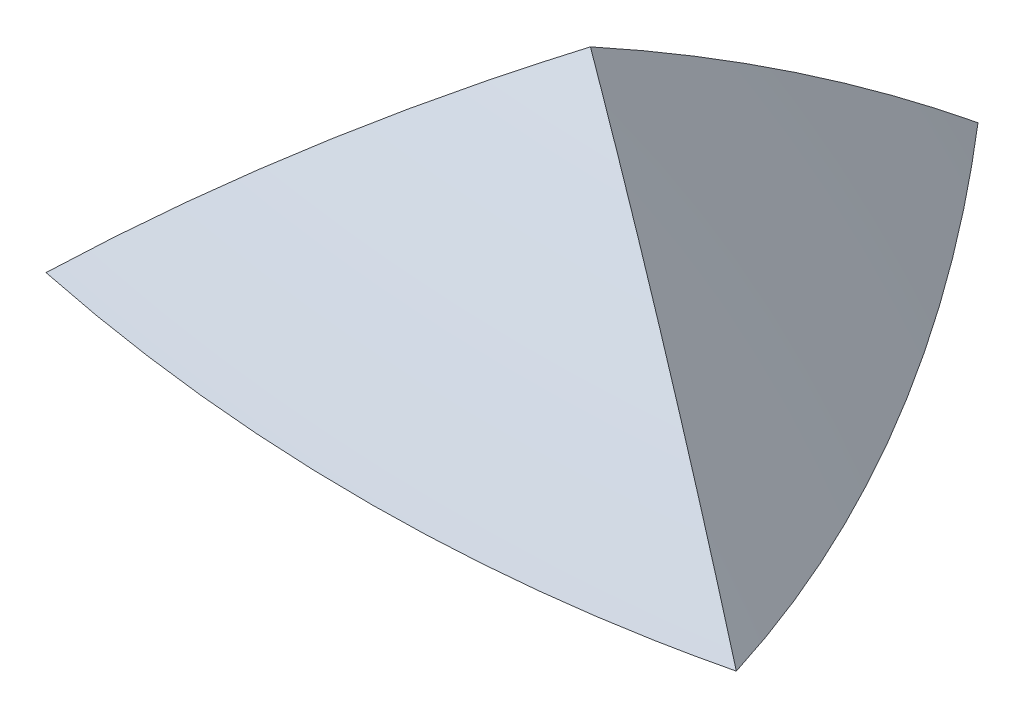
ISO-10303-21;
HEADER;
FILE_DESCRIPTION(('STEP AP214'),'2;1');
FILE_NAME('part.step','',(''),(''),'','','');
FILE_SCHEMA(('AUTOMOTIVE_DESIGN { 1 0 10303 214 1 1 1 1 }'));
ENDSEC;
DATA;
#1=APPLICATION_CONTEXT('core data for automotive mechanical design processes');
#2=APPLICATION_PROTOCOL_DEFINITION('international standard','automotive_design',2000,#1);
#3=PRODUCT_CONTEXT('',#1,'mechanical');
#4=PRODUCT('Part','Part','',(#3));
#5=PRODUCT_RELATED_PRODUCT_CATEGORY('part','',(#4));
#6=PRODUCT_DEFINITION_FORMATION('','',#4);
#7=PRODUCT_DEFINITION_CONTEXT('part definition',#1,'design');
#8=PRODUCT_DEFINITION('design','',#6,#7);
#9=PRODUCT_DEFINITION_SHAPE('','',#8);
#10=(LENGTH_UNIT() NAMED_UNIT(*) SI_UNIT(.MILLI.,.METRE.));
#11=(NAMED_UNIT(*) PLANE_ANGLE_UNIT() SI_UNIT($,.RADIAN.));
#12=(NAMED_UNIT(*) SI_UNIT($,.STERADIAN.) SOLID_ANGLE_UNIT());
#13=UNCERTAINTY_MEASURE_WITH_UNIT(LENGTH_MEASURE(1.E-05),#10,'distance_accuracy_value','');
#14=(GEOMETRIC_REPRESENTATION_CONTEXT(3) GLOBAL_UNCERTAINTY_ASSIGNED_CONTEXT((#13)) GLOBAL_UNIT_ASSIGNED_CONTEXT((#10,
#11,#12)) REPRESENTATION_CONTEXT('',''));
#15=CARTESIAN_POINT('',(0.,0.,0.));
#16=DIRECTION('',(0.,0.,1.));
#17=DIRECTION('',(1.,0.,0.));
#18=AXIS2_PLACEMENT_3D('',#15,#16,#17);
#19=CARTESIAN_POINT('',(0.,513.360685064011,2.99417763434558));
#20=DIRECTION('',(-1.,0.,0.));
#21=DIRECTION('',(0.,-0.981627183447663,-0.190808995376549));
#22=AXIS2_PLACEMENT_3D('',#19,#20,#21);
#23=DEGENERATE_TOROIDAL_SURFACE('',#22,255.10822368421,766.90822368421,.F.);
#24=CARTESIAN_POINT('',(13.5371691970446,9.30922297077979,-85.0346370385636));
#25=CARTESIAN_POINT('',(10.5148602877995,8.69471518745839,-81.8262953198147));
#26=CARTESIAN_POINT('',(7.54687147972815,8.12082598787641,-78.5589356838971));
#27=CARTESIAN_POINT('',(1.72429613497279,7.05700209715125,-71.9112039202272));
#28=CARTESIAN_POINT('',(-1.13028542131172,6.56707108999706,-68.5308268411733));
#29=CARTESIAN_POINT('',(-6.72270788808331,5.67366538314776,-61.6602900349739));
#30=CARTESIAN_POINT('',(-9.46047718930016,5.27024312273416,-58.1700651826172));
#31=CARTESIAN_POINT('',(-14.8124499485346,4.55279768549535,-51.0872790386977));
#32=CARTESIAN_POINT('',(-17.4266560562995,4.23877259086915,-47.4947199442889));
#33=CARTESIAN_POINT('',(-22.4697077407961,3.70849802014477,-40.294056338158));
#34=CARTESIAN_POINT('',(-24.9013870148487,3.49022409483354,-36.6880854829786));
#35=CARTESIAN_POINT('',(-29.6372449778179,3.14350276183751,-29.3891598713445));
#36=CARTESIAN_POINT('',(-31.9414246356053,3.01505467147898,-25.6962057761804));
#37=CARTESIAN_POINT('',(-36.4166719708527,2.84992064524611,-18.2305466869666));
#38=CARTESIAN_POINT('',(-38.5877947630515,2.81319646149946,-14.4578755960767));
#39=CARTESIAN_POINT('',(-42.7930584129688,2.83309453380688,-6.83761396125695));
#40=CARTESIAN_POINT('',(-44.8272099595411,2.88970949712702,-2.99002929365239));
#41=CARTESIAN_POINT('',(-49.1297640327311,3.117678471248,5.51717054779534));
#42=CARTESIAN_POINT('',(-51.3685248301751,3.30891238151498,10.1913066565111));
#43=CARTESIAN_POINT('',(-55.6367411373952,3.82797955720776,19.6255747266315));
#44=CARTESIAN_POINT('',(-57.666235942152,4.15578711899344,24.3856903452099));
#45=CARTESIAN_POINT('',(-61.5345614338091,4.95493393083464,34.0465066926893));
#46=CARTESIAN_POINT('',(-63.3704440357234,5.42815344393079,38.9482379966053));
#47=CARTESIAN_POINT('',(-65.9511817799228,6.24512364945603,46.3495820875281));
#48=CARTESIAN_POINT('',(-66.7827133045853,6.53536540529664,48.8252686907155));
#49=CARTESIAN_POINT('',(-68.3870267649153,7.15162191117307,53.7912274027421));
#50=CARTESIAN_POINT('',(-69.1598076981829,7.47763727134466,56.2814997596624));
#51=CARTESIAN_POINT('',(-69.9027440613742,7.82156763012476,58.7783324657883));
#52=B_SPLINE_CURVE_WITH_KNOTS('',3,(#24,#25,#26,#27,#28,#29,#30,#31,#32,#33,#34,#35,#36,#37,#38,
#39,#40,#41,#42,#43,#44,#45,#46,#47,#48,#49,#50,#51),.UNSPECIFIED.,.F.,.F.,(4,2,2,2,2,2,2,2,2,2,
2,2,2,4),(0.,13.3501534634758,26.7008925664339,40.0597017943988,53.4182244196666,
66.4788177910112,79.5393119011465,92.5943590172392,105.648386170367,121.199954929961,
136.748598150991,152.507416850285,160.389647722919,168.272013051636),.UNSPECIFIED.);
#53=CARTESIAN_POINT('',(5.64050720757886E-13,6.76939473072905,-69.8378521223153));
#54=VERTEX_POINT('',#53);
#55=CARTESIAN_POINT('',(-62.2009206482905,5.15223072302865,35.911718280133));
#56=VERTEX_POINT('',#55);
#57=EDGE_CURVE('E76',#54,#56,#52,.T.);
#58=ORIENTED_EDGE('',*,*,#57,.F.);
#59=CARTESIAN_POINT('',(71.0341653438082,8.37095915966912,62.6670987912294));
#60=CARTESIAN_POINT('',(70.4324020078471,8.06451782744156,60.5508282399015));
#61=CARTESIAN_POINT('',(69.809116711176,7.77087285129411,58.438912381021));
#62=CARTESIAN_POINT('',(68.5200689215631,7.2091601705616,54.2246970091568));
#63=CARTESIAN_POINT('',(67.8543070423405,6.94109209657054,52.1223973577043));
#64=CARTESIAN_POINT('',(65.7942883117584,6.17527635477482,45.8316763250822));
#65=CARTESIAN_POINT('',(64.3371590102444,5.71584634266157,41.6589432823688));
#66=CARTESIAN_POINT('',(61.2607692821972,4.89900001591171,33.3649177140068));
#67=CARTESIAN_POINT('',(59.6415474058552,4.54155952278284,29.2436132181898));
#68=CARTESIAN_POINT('',(56.2455993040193,3.92779814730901,21.0587223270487));
#69=CARTESIAN_POINT('',(54.4688721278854,3.67147787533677,16.9951362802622));
#70=CARTESIAN_POINT('',(50.8042834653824,3.26353469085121,9.02286068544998));
#71=CARTESIAN_POINT('',(48.9197826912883,3.1097050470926,5.11273756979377));
#72=CARTESIAN_POINT('',(45.009735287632,2.8964963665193,-2.63896852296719));
#73=CARTESIAN_POINT('',(42.9841877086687,2.83711796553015,-6.48055103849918));
#74=CARTESIAN_POINT('',(38.7971169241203,2.81135249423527,-14.0883111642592));
#75=CARTESIAN_POINT('',(36.6356177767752,2.84494901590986,-17.8545019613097));
#76=CARTESIAN_POINT('',(32.1811978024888,3.00340316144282,-25.3059560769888));
#77=CARTESIAN_POINT('',(29.8882848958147,3.12825529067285,-28.9912242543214));
#78=CARTESIAN_POINT('',(24.5244050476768,3.51420294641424,-37.2818466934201));
#79=CARTESIAN_POINT('',(21.4134795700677,3.80340737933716,-41.8601429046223));
#80=CARTESIAN_POINT('',(14.9953090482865,4.52301539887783,-50.8637487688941));
#81=CARTESIAN_POINT('',(11.6881054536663,4.95338925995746,-55.289090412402));
#82=CARTESIAN_POINT('',(4.83637955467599,5.95793257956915,-64.0408969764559));
#83=CARTESIAN_POINT('',(1.28909885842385,6.53410831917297,-68.3649774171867));
#84=CARTESIAN_POINT('',(-4.16910854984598,7.49971659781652,-74.7176143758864));
#85=CARTESIAN_POINT('',(-6.01163498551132,7.83852630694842,-76.8131705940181));
#86=CARTESIAN_POINT('',(-9.74124677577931,8.54923130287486,-80.9585036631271));
#87=CARTESIAN_POINT('',(-11.6283319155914,8.9211264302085,-83.0082807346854));
#88=CARTESIAN_POINT('',(-13.537169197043,9.30922297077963,-85.0346370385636));
#89=B_SPLINE_CURVE_WITH_KNOTS('',3,(#59,#60,#61,#62,#63,#64,#65,#66,#67,#68,#69,#70,#71,#72,#73,
#74,#75,#76,#77,#78,#79,#80,#81,#82,#83,#84,#85,#86,#87,#88),.UNSPECIFIED.,.F.,.F.,(4,2,2,2,2,2,
2,2,2,2,2,2,2,2,4),(0.,6.66389724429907,13.3276982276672,26.6537598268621,39.9766596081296,
53.2996398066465,66.3255967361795,79.351641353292,92.3753873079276,105.398349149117,
122.018834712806,138.6358228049,155.495242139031,163.92709538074,172.358907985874),.UNSPECIFIED.);
#90=CARTESIAN_POINT('',(62.2009206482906,5.15223072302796,35.9117182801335));
#91=VERTEX_POINT('',#90);
#92=EDGE_CURVE('E11',#91,#54,#89,.T.);
#93=ORIENTED_EDGE('',*,*,#92,.F.);
#94=CARTESIAN_POINT('',(-76.2502000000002,6.27939220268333,33.5317303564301));
#95=CARTESIAN_POINT('',(-73.6458787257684,6.04810753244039,34.0200851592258));
#96=CARTESIAN_POINT('',(-71.0358102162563,5.82886499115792,34.4830131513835));
#97=CARTESIAN_POINT('',(-65.8054995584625,5.41446227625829,35.358019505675));
#98=CARTESIAN_POINT('',(-63.1852583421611,5.21929994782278,35.770102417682));
#99=CARTESIAN_POINT('',(-55.3106793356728,4.66988021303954,36.9301955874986));
#100=CARTESIAN_POINT('',(-50.0423629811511,4.35167912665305,37.6020733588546));
#101=CARTESIAN_POINT('',(-39.4758959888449,3.81125804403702,38.743165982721));
#102=CARTESIAN_POINT('',(-34.1777292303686,3.58909622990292,39.2122579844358));
#103=CARTESIAN_POINT('',(-23.564158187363,3.2409665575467,39.9473296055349));
#104=CARTESIAN_POINT('',(-18.2487539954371,3.11499818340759,40.2133103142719));
#105=CARTESIAN_POINT('',(-7.6999884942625,2.96054153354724,40.5394436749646));
#106=CARTESIAN_POINT('',(-2.46675492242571,2.93044552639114,40.6029910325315));
#107=CARTESIAN_POINT('',(7.99833149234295,2.963197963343,40.5338346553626));
#108=CARTESIAN_POINT('',(13.2301842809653,3.0260496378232,40.4011240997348));
#109=CARTESIAN_POINT('',(23.6798856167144,3.24464409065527,39.9395645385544));
#110=CARTESIAN_POINT('',(28.897740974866,3.40032750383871,39.610840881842));
#111=CARTESIAN_POINT('',(39.3132316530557,3.80455741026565,38.7573142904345));
#112=CARTESIAN_POINT('',(44.5108698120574,4.05309035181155,38.2325399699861));
#113=CARTESIAN_POINT('',(51.9154991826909,4.47450001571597,37.3427385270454));
#114=CARTESIAN_POINT('',(54.1345690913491,4.60947825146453,37.0577336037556));
#115=CARTESIAN_POINT('',(58.5663940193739,4.89649295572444,36.4517055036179));
#116=CARTESIAN_POINT('',(60.7791498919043,5.04852699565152,36.1306874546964));
#117=CARTESIAN_POINT('',(65.205967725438,5.37026037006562,35.4513512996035));
#118=CARTESIAN_POINT('',(67.420004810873,5.54002233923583,35.0929009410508));
#119=CARTESIAN_POINT('',(71.840817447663,5.89678169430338,34.339607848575));
#120=CARTESIAN_POINT('',(74.0475919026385,6.08378156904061,33.9447598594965));
#121=CARTESIAN_POINT('',(76.2502000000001,6.27939220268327,33.5317303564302));
#122=B_SPLINE_CURVE_WITH_KNOTS('',3,(#94,#95,#96,#97,#98,#99,#100,#101,#102,#103,#104,#105,#106,
#107,#108,#109,#110,#111,#112,#113,#114,#115,#116,#117,#118,#119,#120,#121),.UNSPECIFIED.,.F.,
.F.,(4,2,2,2,2,2,2,2,2,2,2,2,2,4),(0.,7.97903567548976,15.9573568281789,31.913621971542,
47.8795401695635,63.8453727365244,79.5420171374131,95.2392070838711,110.926369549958,
126.611243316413,133.335063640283,140.057927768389,146.805404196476,153.553856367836),.UNSPECIFIED.);
#123=EDGE_CURVE('E59',#56,#91,#122,.T.);
#124=ORIENTED_EDGE('',*,*,#123,.F.);
#125=EDGE_LOOP('',(#58,#93,#124));
#126=FACE_BOUND('',#125,.T.);
#127=ADVANCED_FACE('F54',(#126),#23,.F.);
#128=CARTESIAN_POINT('',(-327.469526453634,-291.376829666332,189.064619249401));
#129=DIRECTION('',(0.499999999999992,0.,0.866025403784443));
#130=DIRECTION('',(0.709406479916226,0.573576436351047,-0.409576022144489));
#131=AXIS2_PLACEMENT_3D('',#128,#129,#130);
#132=DEGENERATE_TOROIDAL_SURFACE('',#131,255.10822368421,766.90822368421,.F.);
#133=CARTESIAN_POINT('',(-2.37750234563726E-13,71.347697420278,35.9119182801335));
#134=CARTESIAN_POINT('',(-1.18173455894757E-13,69.049213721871,30.7692662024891));
#135=CARTESIAN_POINT('',(0.,66.6640866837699,25.6652370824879));
#136=CARTESIAN_POINT('',(0.,61.7211600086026,15.541268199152));
#137=CARTESIAN_POINT('',(0.,59.1633539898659,10.5213315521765));
#138=CARTESIAN_POINT('',(1.00567318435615E-13,53.88909937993,0.597694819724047));
#139=CARTESIAN_POINT('',(1.78564053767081E-13,51.1735098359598,-4.30646162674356));
#140=CARTESIAN_POINT('',(1.95131859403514E-13,45.5731438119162,-14.0171842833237));
#141=CARTESIAN_POINT('',(1.33704010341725E-13,42.6883686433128,-18.8237512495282));
#142=CARTESIAN_POINT('',(1.97174993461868E-13,36.750520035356,-28.332448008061));
#143=CARTESIAN_POINT('',(3.22091241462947E-13,33.6974308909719,-33.0345679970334));
#144=CARTESIAN_POINT('',(4.33899241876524E-13,27.4246892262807,-42.3263301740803));
#145=CARTESIAN_POINT('',(4.20792396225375E-13,24.2050383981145,-46.9159735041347));
#146=CARTESIAN_POINT('',(4.58501543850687E-13,17.5842879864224,-55.9978607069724));
#147=CARTESIAN_POINT('',(5.09638600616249E-13,14.1823590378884,-60.4895003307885));
#148=CARTESIAN_POINT('',(5.75356488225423E-13,7.21393275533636,-69.3436187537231));
#149=CARTESIAN_POINT('',(5.89935357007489E-13,3.64742659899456,-73.7060906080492));
#150=CARTESIAN_POINT('',(5.35710841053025E-13,-0.00019999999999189,-77.999824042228));
#151=B_SPLINE_CURVE_WITH_KNOTS('',3,(#133,#134,#135,#136,#137,#138,#139,#140,#141,#142,#143,
#144,#145,#146,#147,#148,#149,#150),.UNSPECIFIED.,.F.,.F.,(4,2,2,2,2,2,2,2,4),(0.,
16.8981303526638,33.7968855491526,50.6109736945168,67.4249315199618,84.2404608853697,
101.05581945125,117.955549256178,134.856186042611),.UNSPECIFIED.);
#152=CARTESIAN_POINT('',(0.,53.5253579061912,0.));
#153=VERTEX_POINT('',#152);
#154=EDGE_CURVE('E82',#153,#54,#151,.T.);
#155=ORIENTED_EDGE('',*,*,#154,.F.);
#156=CARTESIAN_POINT('',(66.9582653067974,0.578911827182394,38.6583724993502));
#157=CARTESIAN_POINT('',(64.3307462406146,3.14591300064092,37.1413736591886));
#158=CARTESIAN_POINT('',(61.6738134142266,5.67244581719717,35.6073927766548));
#159=CARTESIAN_POINT('',(56.3033881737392,10.6439314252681,32.5067763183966));
#160=CARTESIAN_POINT('',(53.5898968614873,13.0888858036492,30.9401413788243));
#161=CARTESIAN_POINT('',(45.369052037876,20.2994935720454,26.1938344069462));
#162=CARTESIAN_POINT('',(39.7801557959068,24.9420350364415,22.9670836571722));
#163=CARTESIAN_POINT('',(28.4588708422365,33.8502561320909,16.4307367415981));
#164=CARTESIAN_POINT('',(22.7283254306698,38.1190687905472,13.1222048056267));
#165=CARTESIAN_POINT('',(11.0914469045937,46.3246727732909,6.40364985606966));
#166=CARTESIAN_POINT('',(5.18510903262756,50.2614551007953,2.99362409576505));
#167=CARTESIAN_POINT('',(-6.78443352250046,57.7989921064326,-3.91699452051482));
#168=CARTESIAN_POINT('',(-12.8476032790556,61.3998207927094,-7.41756721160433));
#169=CARTESIAN_POINT('',(-25.1153690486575,68.2643848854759,-14.5003650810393));
#170=CARTESIAN_POINT('',(-31.3199676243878,71.5281141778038,-18.0825917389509));
#171=CARTESIAN_POINT('',(-43.9144563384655,77.7467206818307,-25.3540231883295));
#172=CARTESIAN_POINT('',(-50.3055492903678,80.6983553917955,-29.0439224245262));
#173=CARTESIAN_POINT('',(-59.9751682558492,84.8662788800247,-34.626679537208));
#174=CARTESIAN_POINT('',(-63.2121834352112,86.2123241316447,-36.4955711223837));
#175=CARTESIAN_POINT('',(-69.7121518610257,88.8179989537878,-40.2483296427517));
#176=CARTESIAN_POINT('',(-72.9751047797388,90.0776296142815,-42.1321963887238));
#177=CARTESIAN_POINT('',(-76.2502000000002,91.2941127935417,-44.0230734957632));
#178=B_SPLINE_CURVE_WITH_KNOTS('',3,(#156,#157,#158,#159,#160,#161,#162,#163,#164,#165,#166,
#167,#168,#169,#170,#171,#172,#173,#174,#175,#176,#177),.UNSPECIFIED.,.F.,.F.,(4,2,2,2,2,2,2,2,
2,2,4),(0.,11.9219864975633,23.8437409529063,47.681941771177,71.2960025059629,94.9107028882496,
118.520188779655,142.130102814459,165.965192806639,177.882584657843,189.799826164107),.UNSPECIFIED.);
#179=EDGE_CURVE('E69',#91,#153,#178,.T.);
#180=ORIENTED_EDGE('',*,*,#179,.F.);
#181=ORIENTED_EDGE('',*,*,#92,.T.);
#182=EDGE_LOOP('',(#155,#180,#181));
#183=FACE_BOUND('',#182,.T.);
#184=ADVANCED_FACE('F56',(#183),#132,.F.);
#185=CARTESIAN_POINT('',(0.,-291.376829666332,-378.129238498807));
#186=DIRECTION('',(-1.,0.,0.));
#187=DIRECTION('',(0.,0.573576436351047,0.819152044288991));
#188=AXIS2_PLACEMENT_3D('',#185,#186,#187);
#189=DEGENERATE_TOROIDAL_SURFACE('',#188,255.10822368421,766.90822368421,.F.);
#190=CARTESIAN_POINT('',(-67.5498291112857,-0.0002,38.9999120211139));
#191=CARTESIAN_POINT('',(-65.1530125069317,2.35091816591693,37.616109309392));
#192=CARTESIAN_POINT('',(-62.7315472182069,4.66828623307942,36.2180756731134));
#193=CARTESIAN_POINT('',(-57.8410516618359,9.23502509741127,33.3945467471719));
#194=CARTESIAN_POINT('',(-55.3720221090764,11.4843969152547,31.969051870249));
#195=CARTESIAN_POINT('',(-47.896961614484,18.1290899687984,27.6533236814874));
#196=CARTESIAN_POINT('',(-42.8221062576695,22.4218242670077,24.7233545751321));
#197=CARTESIAN_POINT('',(-32.5457786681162,30.695439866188,18.7903140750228));
#198=CARTESIAN_POINT('',(-27.3456415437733,34.6785381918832,15.7880135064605));
#199=CARTESIAN_POINT('',(-16.7937539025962,42.3675937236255,9.69587833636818));
#200=CARTESIAN_POINT('',(-11.4420001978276,46.073545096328,6.60604189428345));
#201=CARTESIAN_POINT('',(-0.601505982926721,53.2049899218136,0.347279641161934));
#202=CARTESIAN_POINT('',(4.88720994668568,56.6305332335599,-2.82163197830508));
#203=CARTESIAN_POINT('',(15.989618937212,63.2000904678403,-9.23161079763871));
#204=CARTESIAN_POINT('',(21.6033138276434,66.3441002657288,-12.4726790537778));
#205=CARTESIAN_POINT('',(32.9888446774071,72.373482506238,-19.0461183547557));
#206=CARTESIAN_POINT('',(38.7615924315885,75.2565575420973,-22.3790158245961));
#207=CARTESIAN_POINT('',(50.4083900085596,80.7342774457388,-29.1032975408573));
#208=CARTESIAN_POINT('',(56.2824327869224,83.3289422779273,-32.4946777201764));
#209=CARTESIAN_POINT('',(62.2011206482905,85.7791445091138,-35.9118337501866));
#210=B_SPLINE_CURVE_WITH_KNOTS('',3,(#190,#191,#192,#193,#194,#195,#196,#197,#198,#199,#200,
#201,#202,#203,#204,#205,#206,#207,#208,#209),.UNSPECIFIED.,.F.,.F.,(4,2,2,2,2,2,2,2,2,4),(0.,
10.8937616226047,21.7873596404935,43.5706861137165,65.180020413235,86.7898094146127,
108.395747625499,130.002002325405,151.783000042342,173.562489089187),.UNSPECIFIED.);
#211=EDGE_CURVE('E92',#56,#153,#210,.T.);
#212=ORIENTED_EDGE('',*,*,#211,.F.);
#213=ORIENTED_EDGE('',*,*,#123,.T.);
#214=ORIENTED_EDGE('',*,*,#179,.T.);
#215=EDGE_LOOP('',(#212,#213,#214));
#216=FACE_BOUND('',#215,.T.);
#217=ADVANCED_FACE('F91',(#216),#189,.F.);
#218=CARTESIAN_POINT('',(327.469526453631,-291.376829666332,189.064619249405));
#219=DIRECTION('',(0.500000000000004,0.,-0.866025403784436));
#220=DIRECTION('',(-0.70940647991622,0.573576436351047,-0.409576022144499));
#221=AXIS2_PLACEMENT_3D('',#218,#219,#220);
#222=DEGENERATE_TOROIDAL_SURFACE('',#221,255.10822368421,766.90822368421,.F.);
#223=ORIENTED_EDGE('',*,*,#154,.T.);
#224=ORIENTED_EDGE('',*,*,#57,.T.);
#225=ORIENTED_EDGE('',*,*,#211,.T.);
#226=EDGE_LOOP('',(#223,#224,#225));
#227=FACE_BOUND('',#226,.T.);
#228=ADVANCED_FACE('F98',(#227),#222,.F.);
#229=CLOSED_SHELL('',(#127,#184,#217,#228));
#230=MANIFOLD_SOLID_BREP('B2',#229);
#231=ADVANCED_BREP_SHAPE_REPRESENTATION('',(#18,#230),#14);
#232=SHAPE_DEFINITION_REPRESENTATION(#9,#231);
ENDSEC;
END-ISO-10303-21;
